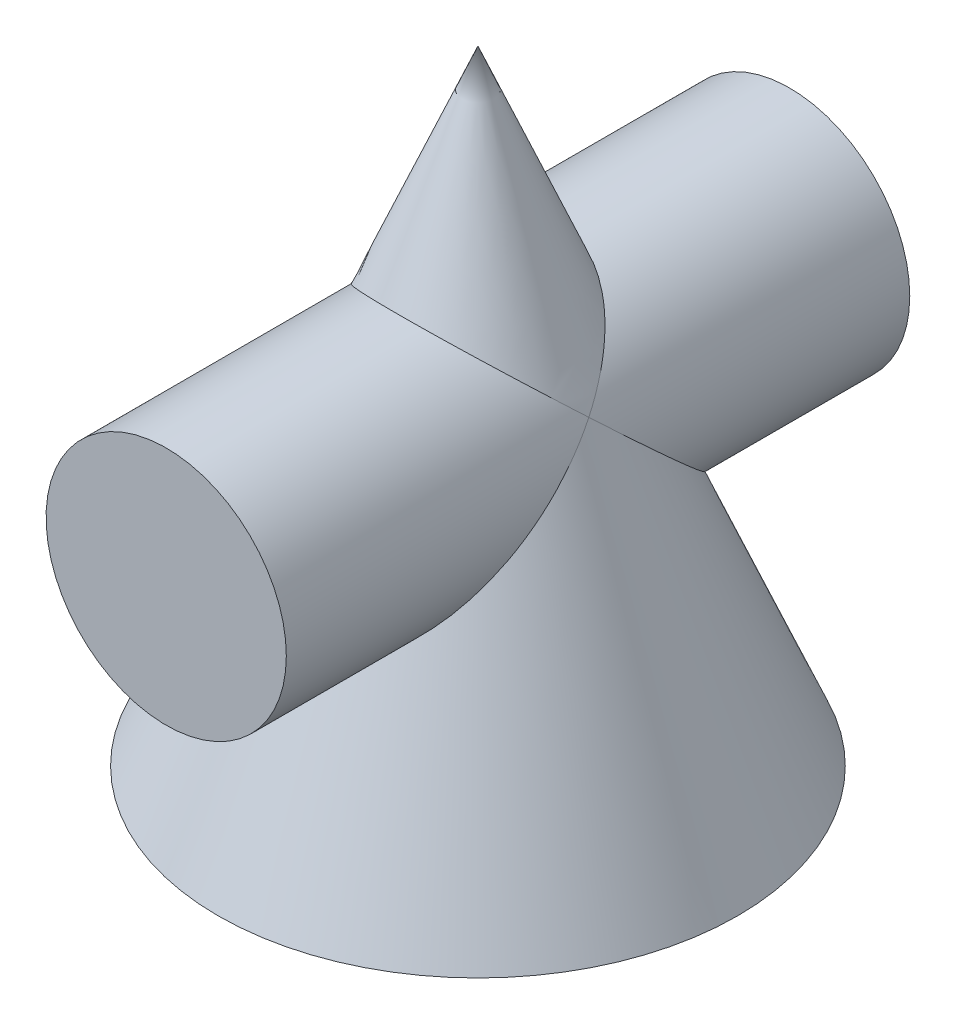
from build123d import *

# Parameters (mm, degrees)
SKETCH_2_R      = 11.560642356
EXTRUDE_1_DEPTH = 30


with BuildPart() as part:
    # Sketch 1 → Revolve 1 (revolve)
    with BuildSketch(Plane.XY, mode=Mode.PRIVATE) as revolve_1_sk:
        Polygon((0, 60.511764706), (-25, 0.511764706), (0, 0.511764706), align=None)
    revolve(revolve_1_sk.sketch.rotate(Axis((0, 86.658823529, 0), (0, -1, 0)), 90), axis=Axis((0, 86.658823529, 0), (0, -1, 0)))

    # Sketch 2 → Extrude 1 (add, symmetric)
    with BuildSketch(Plane.XY):
        with Locations(Location((0, 30.454094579, 0), (0, 0, 157.380135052))):
            Circle(SKETCH_2_R)
    extrude(amount=EXTRUDE_1_DEPTH, both=True)


solid = part.part
